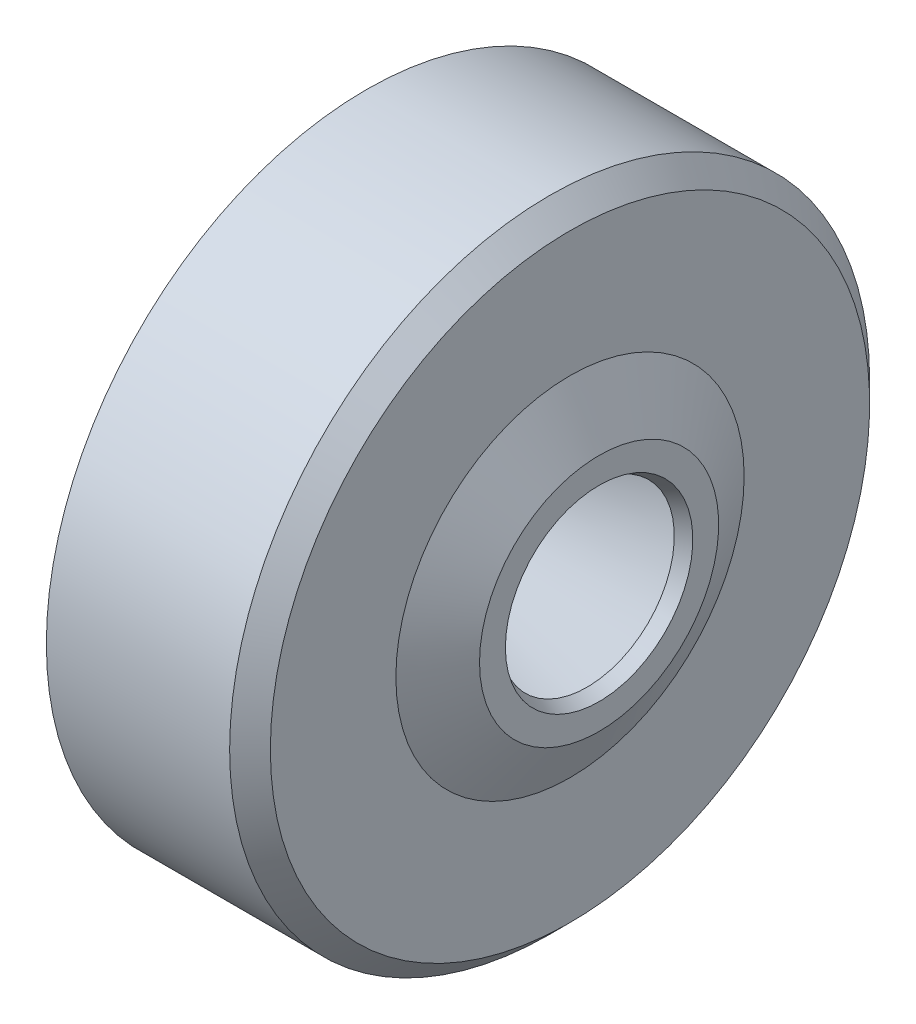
from build123d import *


with BuildPart() as part:
    # Ske → Base-Rev (revolve)
    with BuildSketch(Plane.XY, mode=Mode.PRIVATE) as base_rev_sk:
        with BuildLine():
            Line((1.4, 5.985714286), (0.7, 5.985714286))
            Line((0.7, 5.985714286), (0.7, 4.119399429))
            Line((0.7, 4.119399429), (2.1, 3))
            Line((2.1, 3), (7, 5.985714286))
            Line((7, 5.985714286), (7, 10.3))
            Line((7, 10.3), (6.3, 11))
            Line((6.3, 11), (0, 11))
            Line((0, 11), (0, 9.222222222))
            Line((0, 9.222222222), (3.966666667, 9.222222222))
            ThreePointArc((3.966666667, 9.222222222), (4.461641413, 9.017196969), (4.666666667, 8.522222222))
            Line((4.666666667, 8.522222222), (4.666666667, 5.985714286))
            ThreePointArc((4.666666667, 5.985714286), (4.461641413, 5.490739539), (3.966666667, 5.285714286))
            Line((3.966666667, 5.285714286), (2.1, 5.285714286))
            ThreePointArc((2.1, 5.285714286), (2.594974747, 6.480689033), (1.4, 5.985714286))
        make_face()
    revolve(base_rev_sk.sketch.rotate(Axis((-7, 0, 0), (1, 0, 0)), 90), axis=Axis((-7, 0, 0), (1, 0, 0)))

    # Ske2 → Rev1 (revolve)
    with BuildSketch(Plane.XY, mode=Mode.PRIVATE) as rev1_sk:
        Polygon((7, 5.985714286), (8, 4.110338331), (8, 3.221449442), (7.584699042, 3), (5.992637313, 5.985714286), align=None)
    revolve(rev1_sk.sketch.rotate(Axis((-1.306140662, 0, 0), (1, 0, 0)), 90), axis=Axis((-1.306140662, 0, 0), (1, 0, 0)))


solid = part.part
